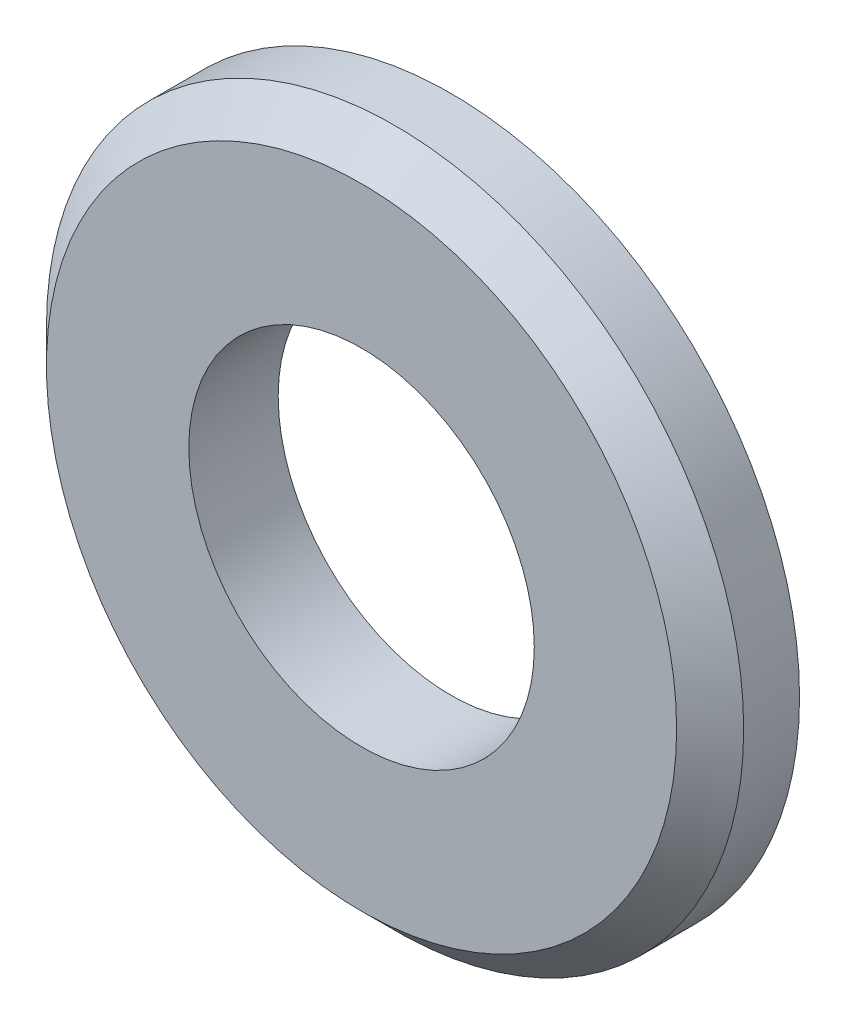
from build123d import *

# Parameters (mm, degrees)
SKETCH1_R           = 3.9624
SKETCH1_R_2         = 1.96342
BOSS_EXTRUDE1_DEPTH = 1.016
CHAMFER1_SIZE       = 0.381


with BuildPart() as part:
    # Sketch1 → Boss-Extrude1 (new body)
    with BuildSketch(Plane.XY):
        Circle(SKETCH1_R)
        Circle(SKETCH1_R_2, mode=Mode.SUBTRACT)
    extrude(amount=BOSS_EXTRUDE1_DEPTH)

    # Chamfer1
    chamfer1_edges = [part.edges().sort_by_distance(p)[0] for p in [
        (-3.9624, 0, 1.016),
    ]]
    chamfer(chamfer1_edges, length=CHAMFER1_SIZE)


solid = part.part
